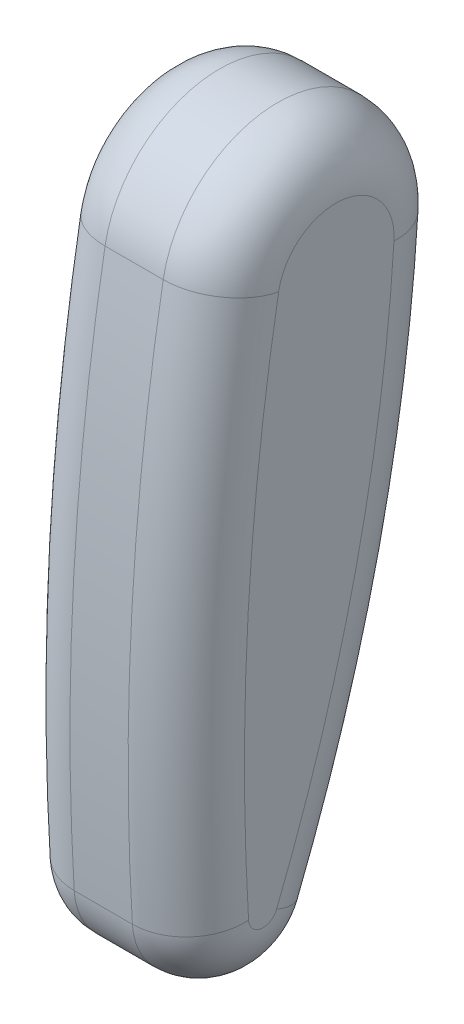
ISO-10303-21;
HEADER;
FILE_DESCRIPTION(('STEP AP214'),'2;1');
FILE_NAME('part.step','',(''),(''),'','','');
FILE_SCHEMA(('AUTOMOTIVE_DESIGN { 1 0 10303 214 1 1 1 1 }'));
ENDSEC;
DATA;
#1=APPLICATION_CONTEXT('core data for automotive mechanical design processes');
#2=APPLICATION_PROTOCOL_DEFINITION('international standard','automotive_design',2000,#1);
#3=PRODUCT_CONTEXT('',#1,'mechanical');
#4=PRODUCT('Part','Part','',(#3));
#5=PRODUCT_RELATED_PRODUCT_CATEGORY('part','',(#4));
#6=PRODUCT_DEFINITION_FORMATION('','',#4);
#7=PRODUCT_DEFINITION_CONTEXT('part definition',#1,'design');
#8=PRODUCT_DEFINITION('design','',#6,#7);
#9=PRODUCT_DEFINITION_SHAPE('','',#8);
#10=(LENGTH_UNIT() NAMED_UNIT(*) SI_UNIT(.MILLI.,.METRE.));
#11=(NAMED_UNIT(*) PLANE_ANGLE_UNIT() SI_UNIT($,.RADIAN.));
#12=(NAMED_UNIT(*) SI_UNIT($,.STERADIAN.) SOLID_ANGLE_UNIT());
#13=UNCERTAINTY_MEASURE_WITH_UNIT(LENGTH_MEASURE(1.E-05),#10,'distance_accuracy_value','');
#14=(GEOMETRIC_REPRESENTATION_CONTEXT(3) GLOBAL_UNCERTAINTY_ASSIGNED_CONTEXT((#13)) GLOBAL_UNIT_ASSIGNED_CONTEXT((#10,
#11,#12)) REPRESENTATION_CONTEXT('',''));
#15=CARTESIAN_POINT('',(0.,0.,0.));
#16=DIRECTION('',(0.,0.,1.));
#17=DIRECTION('',(1.,0.,0.));
#18=AXIS2_PLACEMENT_3D('',#15,#16,#17);
#19=CARTESIAN_POINT('',(38.1,-636.965855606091,-1940.75192617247));
#20=DIRECTION('',(1.,0.,0.));
#21=DIRECTION('',(0.,0.,-1.));
#22=AXIS2_PLACEMENT_3D('',#19,#20,#21);
#23=CYLINDRICAL_SURFACE('',#22,2032.);
#24=DIRECTION('',(1.,0.,0.));
#25=VECTOR('',#24,1.);
#26=CARTESIAN_POINT('',(38.1,-759.542851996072,87.547578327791));
#27=LINE('',#26,#25);
#28=CARTESIAN_POINT('',(88.9,-759.542851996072,87.547578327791));
#29=VERTEX_POINT('',#28);
#30=CARTESIAN_POINT('',(139.7,-759.542851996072,87.547578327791));
#31=VERTEX_POINT('',#30);
#32=EDGE_CURVE('E129',#29,#31,#27,.T.);
#33=ORIENTED_EDGE('',*,*,#32,.T.);
#34=CARTESIAN_POINT('',(139.7,-636.965855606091,-1940.75192617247));
#35=DIRECTION('',(-1.,0.,0.));
#36=DIRECTION('',(0.,0.,1.));
#37=AXIS2_PLACEMENT_3D('',#34,#35,#36);
#38=CIRCLE('',#37,2032.);
#39=CARTESIAN_POINT('',(139.7,-285.382596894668,60.6009193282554));
#40=VERTEX_POINT('',#39);
#41=EDGE_CURVE('E11',#31,#40,#38,.T.);
#42=ORIENTED_EDGE('',*,*,#41,.T.);
#43=DIRECTION('',(1.,0.,0.));
#44=VECTOR('',#43,1.);
#45=CARTESIAN_POINT('',(38.1,-285.382596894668,60.6009193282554));
#46=LINE('',#45,#44);
#47=CARTESIAN_POINT('',(88.9,-285.382596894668,60.6009193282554));
#48=VERTEX_POINT('',#47);
#49=EDGE_CURVE('E123',#48,#40,#46,.T.);
#50=ORIENTED_EDGE('',*,*,#49,.F.);
#51=CARTESIAN_POINT('',(88.9,-636.965855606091,-1940.75192617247));
#52=DIRECTION('',(-1.,0.,0.));
#53=DIRECTION('',(0.,0.,1.));
#54=AXIS2_PLACEMENT_3D('',#51,#52,#53);
#55=CIRCLE('',#54,2032.);
#56=EDGE_CURVE('E44',#48,#29,#55,.F.);
#57=ORIENTED_EDGE('',*,*,#56,.T.);
#58=EDGE_LOOP('',(#33,#42,#50,#57));
#59=FACE_BOUND('',#58,.T.);
#60=ADVANCED_FACE('F35',(#59),#23,.T.);
#61=CARTESIAN_POINT('',(38.1,-302.961759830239,-39.4667229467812));
#62=DIRECTION('',(1.,0.,0.));
#63=DIRECTION('',(0.,0.,-1.));
#64=AXIS2_PLACEMENT_3D('',#61,#62,#63);
#65=CYLINDRICAL_SURFACE('',#64,101.6);
#66=ORIENTED_EDGE('',*,*,#49,.T.);
#67=CARTESIAN_POINT('',(139.7,-302.961759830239,-39.4667229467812));
#68=DIRECTION('',(-1.,0.,0.));
#69=DIRECTION('',(0.,0.,1.));
#70=AXIS2_PLACEMENT_3D('',#67,#68,#69);
#71=CIRCLE('',#70,101.6);
#72=CARTESIAN_POINT('',(139.7,-309.38746156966,-140.863322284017));
#73=VERTEX_POINT('',#72);
#74=EDGE_CURVE('E126',#40,#73,#71,.T.);
#75=ORIENTED_EDGE('',*,*,#74,.T.);
#76=DIRECTION('',(1.,0.,0.));
#77=VECTOR('',#76,1.);
#78=CARTESIAN_POINT('',(38.1,-309.38746156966,-140.863322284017));
#79=LINE('',#78,#77);
#80=CARTESIAN_POINT('',(88.9,-309.38746156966,-140.863322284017));
#81=VERTEX_POINT('',#80);
#82=EDGE_CURVE('E179',#81,#73,#79,.T.);
#83=ORIENTED_EDGE('',*,*,#82,.F.);
#84=CARTESIAN_POINT('',(88.9,-302.961759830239,-39.4667229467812));
#85=DIRECTION('',(-1.,0.,0.));
#86=DIRECTION('',(0.,0.,1.));
#87=AXIS2_PLACEMENT_3D('',#84,#85,#86);
#88=CIRCLE('',#87,101.6);
#89=EDGE_CURVE('E157',#81,#48,#88,.F.);
#90=ORIENTED_EDGE('',*,*,#89,.T.);
#91=EDGE_LOOP('',(#66,#75,#83,#90));
#92=FACE_BOUND('',#91,.T.);
#93=ADVANCED_FACE('F184',(#92),#65,.T.);
#94=CARTESIAN_POINT('',(38.1,-213.001935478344,1380.08566777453));
#95=DIRECTION('',(1.,0.,0.));
#96=DIRECTION('',(0.,0.,-1.));
#97=AXIS2_PLACEMENT_3D('',#94,#95,#96);
#98=CYLINDRICAL_SURFACE('',#97,1524.);
#99=ORIENTED_EDGE('',*,*,#82,.T.);
#100=CARTESIAN_POINT('',(139.7,-213.001935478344,1380.08566777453));
#101=DIRECTION('',(-1.,0.,0.));
#102=DIRECTION('',(0.,0.,1.));
#103=AXIS2_PLACEMENT_3D('',#100,#101,#102);
#104=CIRCLE('',#103,1524.);
#105=CARTESIAN_POINT('',(139.7,-779.308424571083,-34.7899311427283));
#106=VERTEX_POINT('',#105);
#107=EDGE_CURVE('E168',#73,#106,#104,.T.);
#108=ORIENTED_EDGE('',*,*,#107,.T.);
#109=DIRECTION('',(1.,0.,0.));
#110=VECTOR('',#109,1.);
#111=CARTESIAN_POINT('',(38.1,-779.308424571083,-34.7899311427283));
#112=LINE('',#111,#110);
#113=CARTESIAN_POINT('',(88.9,-779.308424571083,-34.7899311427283));
#114=VERTEX_POINT('',#113);
#115=EDGE_CURVE('E177',#114,#106,#112,.T.);
#116=ORIENTED_EDGE('',*,*,#115,.F.);
#117=CARTESIAN_POINT('',(88.9,-213.001935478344,1380.08566777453));
#118=DIRECTION('',(-1.,0.,0.));
#119=DIRECTION('',(0.,0.,1.));
#120=AXIS2_PLACEMENT_3D('',#117,#118,#119);
#121=CIRCLE('',#120,1524.);
#122=EDGE_CURVE('E171',#114,#81,#121,.F.);
#123=ORIENTED_EDGE('',*,*,#122,.T.);
#124=EDGE_LOOP('',(#99,#108,#116,#123));
#125=FACE_BOUND('',#124,.T.);
#126=ADVANCED_FACE('F194',(#125),#98,.T.);
#127=CARTESIAN_POINT('',(38.1,-755.712320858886,24.1632188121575));
#128=DIRECTION('',(1.,0.,0.));
#129=DIRECTION('',(0.,0.,-1.));
#130=AXIS2_PLACEMENT_3D('',#127,#128,#129);
#131=CYLINDRICAL_SURFACE('',#130,63.5000000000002);
#132=ORIENTED_EDGE('',*,*,#115,.T.);
#133=CARTESIAN_POINT('',(139.7,-755.712320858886,24.1632188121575));
#134=DIRECTION('',(-1.,0.,0.));
#135=DIRECTION('',(0.,0.,1.));
#136=AXIS2_PLACEMENT_3D('',#133,#134,#135);
#137=CIRCLE('',#136,63.5000000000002);
#138=EDGE_CURVE('E52',#106,#31,#137,.T.);
#139=ORIENTED_EDGE('',*,*,#138,.T.);
#140=ORIENTED_EDGE('',*,*,#32,.F.);
#141=CARTESIAN_POINT('',(88.9,-755.712320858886,24.1632188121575));
#142=DIRECTION('',(-1.,0.,0.));
#143=DIRECTION('',(0.,0.,1.));
#144=AXIS2_PLACEMENT_3D('',#141,#142,#143);
#145=CIRCLE('',#144,63.5000000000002);
#146=EDGE_CURVE('E154',#29,#114,#145,.F.);
#147=ORIENTED_EDGE('',*,*,#146,.T.);
#148=EDGE_LOOP('',(#132,#139,#140,#147));
#149=FACE_BOUND('',#148,.T.);
#150=ADVANCED_FACE('F192',(#149),#131,.T.);
#151=CARTESIAN_POINT('',(38.1,-469.963807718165,-990.109324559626));
#152=DIRECTION('',(-1.,0.,0.));
#153=DIRECTION('',(0.,0.,1.));
#154=AXIS2_PLACEMENT_3D('',#151,#152,#153);
#155=PLANE('',#154);
#156=CARTESIAN_POINT('',(38.1,-302.961759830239,-39.4667229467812));
#157=DIRECTION('',(-1.,0.,0.));
#158=DIRECTION('',(0.,0.,1.));
#159=AXIS2_PLACEMENT_3D('',#156,#157,#158);
#160=CIRCLE('',#159,50.8000000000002);
#161=CARTESIAN_POINT('',(38.1,-294.172178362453,10.5670981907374));
#162=VERTEX_POINT('',#161);
#163=CARTESIAN_POINT('',(38.1,-306.174610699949,-90.1650226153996));
#164=VERTEX_POINT('',#163);
#165=EDGE_CURVE('E162',#162,#164,#160,.T.);
#166=ORIENTED_EDGE('',*,*,#165,.T.);
#167=CARTESIAN_POINT('',(38.1,-213.001935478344,1380.08566777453));
#168=DIRECTION('',(-1.,0.,0.));
#169=DIRECTION('',(0.,0.,1.));
#170=AXIS2_PLACEMENT_3D('',#167,#168,#169);
#171=CIRCLE('',#170,1473.2);
#172=CARTESIAN_POINT('',(38.1,-760.431541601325,12.3725888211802));
#173=VERTEX_POINT('',#172);
#174=EDGE_CURVE('E159',#164,#173,#171,.T.);
#175=ORIENTED_EDGE('',*,*,#174,.T.);
#176=CARTESIAN_POINT('',(38.1,-755.712320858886,24.1632188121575));
#177=DIRECTION('',(-1.,0.,0.));
#178=DIRECTION('',(0.,0.,1.));
#179=AXIS2_PLACEMENT_3D('',#176,#177,#178);
#180=CIRCLE('',#179,12.7000000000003);
#181=CARTESIAN_POINT('',(38.1,-756.478427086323,36.8400907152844));
#182=VERTEX_POINT('',#181);
#183=EDGE_CURVE('E164',#173,#182,#180,.T.);
#184=ORIENTED_EDGE('',*,*,#183,.T.);
#185=CARTESIAN_POINT('',(38.1,-636.965855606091,-1940.75192617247));
#186=DIRECTION('',(-1.,0.,0.));
#187=DIRECTION('',(0.,0.,1.));
#188=AXIS2_PLACEMENT_3D('',#185,#186,#187);
#189=CIRCLE('',#188,1981.2);
#190=EDGE_CURVE('E166',#182,#162,#189,.T.);
#191=ORIENTED_EDGE('',*,*,#190,.T.);
#192=EDGE_LOOP('',(#166,#175,#184,#191));
#193=FACE_BOUND('',#192,.T.);
#194=ADVANCED_FACE('F237',(#193),#155,.T.);
#195=CARTESIAN_POINT('',(190.5,-469.963807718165,-990.109324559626));
#196=DIRECTION('',(-1.,0.,0.));
#197=DIRECTION('',(0.,0.,1.));
#198=AXIS2_PLACEMENT_3D('',#195,#196,#197);
#199=PLANE('',#198);
#200=CARTESIAN_POINT('',(190.5,-755.712320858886,24.1632188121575));
#201=DIRECTION('',(-1.,0.,0.));
#202=DIRECTION('',(0.,0.,1.));
#203=AXIS2_PLACEMENT_3D('',#200,#201,#202);
#204=CIRCLE('',#203,12.7000000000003);
#205=CARTESIAN_POINT('',(190.5,-756.478427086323,36.8400907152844));
#206=VERTEX_POINT('',#205);
#207=CARTESIAN_POINT('',(190.5,-760.431541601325,12.3725888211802));
#208=VERTEX_POINT('',#207);
#209=EDGE_CURVE('E112',#206,#208,#204,.F.);
#210=ORIENTED_EDGE('',*,*,#209,.T.);
#211=CARTESIAN_POINT('',(190.5,-213.001935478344,1380.08566777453));
#212=DIRECTION('',(-1.,0.,0.));
#213=DIRECTION('',(0.,0.,1.));
#214=AXIS2_PLACEMENT_3D('',#211,#212,#213);
#215=CIRCLE('',#214,1473.2);
#216=CARTESIAN_POINT('',(190.5,-306.174610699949,-90.1650226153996));
#217=VERTEX_POINT('',#216);
#218=EDGE_CURVE('E108',#208,#217,#215,.F.);
#219=ORIENTED_EDGE('',*,*,#218,.T.);
#220=CARTESIAN_POINT('',(190.5,-302.961759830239,-39.4667229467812));
#221=DIRECTION('',(-1.,0.,0.));
#222=DIRECTION('',(0.,0.,1.));
#223=AXIS2_PLACEMENT_3D('',#220,#221,#222);
#224=CIRCLE('',#223,50.8000000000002);
#225=CARTESIAN_POINT('',(190.5,-294.172178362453,10.5670981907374));
#226=VERTEX_POINT('',#225);
#227=EDGE_CURVE('E102',#217,#226,#224,.F.);
#228=ORIENTED_EDGE('',*,*,#227,.T.);
#229=CARTESIAN_POINT('',(190.5,-636.965855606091,-1940.75192617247));
#230=DIRECTION('',(-1.,0.,0.));
#231=DIRECTION('',(0.,0.,1.));
#232=AXIS2_PLACEMENT_3D('',#229,#230,#231);
#233=CIRCLE('',#232,1981.2);
#234=EDGE_CURVE('E105',#226,#206,#233,.F.);
#235=ORIENTED_EDGE('',*,*,#234,.T.);
#236=EDGE_LOOP('',(#210,#219,#228,#235));
#237=FACE_BOUND('',#236,.T.);
#238=ADVANCED_FACE('F104',(#237),#199,.F.);
#239=CARTESIAN_POINT('',(139.7,-636.965855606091,-1940.75192617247));
#240=DIRECTION('',(-1.,0.,0.));
#241=DIRECTION('',(0.,0.,1.));
#242=AXIS2_PLACEMENT_3D('',#239,#240,#241);
#243=TOROIDAL_SURFACE('',#242,1981.2,50.8);
#244=CARTESIAN_POINT('',(139.7,-294.172178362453,10.5670981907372));
#245=DIRECTION('',(0.,0.984917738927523,-0.173023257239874));
#246=DIRECTION('',(0.,0.173023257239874,0.984917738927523));
#247=AXIS2_PLACEMENT_3D('',#244,#245,#246);
#248=CIRCLE('',#247,50.8);
#249=EDGE_CURVE('E118',#40,#226,#248,.T.);
#250=ORIENTED_EDGE('',*,*,#249,.F.);
#251=ORIENTED_EDGE('',*,*,#41,.F.);
#252=CARTESIAN_POINT('',(139.7,-756.478427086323,36.8400907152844));
#253=DIRECTION('',(0.,-0.998178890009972,-0.060323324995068));
#254=DIRECTION('',(0.,0.060323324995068,-0.998178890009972));
#255=AXIS2_PLACEMENT_3D('',#252,#253,#254);
#256=CIRCLE('',#255,50.8);
#257=EDGE_CURVE('E121',#206,#31,#256,.T.);
#258=ORIENTED_EDGE('',*,*,#257,.F.);
#259=ORIENTED_EDGE('',*,*,#234,.F.);
#260=EDGE_LOOP('',(#250,#251,#258,#259));
#261=FACE_BOUND('',#260,.T.);
#262=ADVANCED_FACE('F116',(#261),#243,.T.);
#263=CARTESIAN_POINT('',(139.7,-755.712320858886,24.1632188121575));
#264=DIRECTION('',(-1.,0.,0.));
#265=DIRECTION('',(0.,0.,1.));
#266=AXIS2_PLACEMENT_3D('',#263,#264,#265);
#267=DEGENERATE_TOROIDAL_SURFACE('',#266,12.7000000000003,50.8,.T.);
#268=ORIENTED_EDGE('',*,*,#257,.T.);
#269=ORIENTED_EDGE('',*,*,#138,.F.);
#270=CARTESIAN_POINT('',(139.7,-760.431541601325,12.3725888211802));
#271=DIRECTION('',(0.,0.928396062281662,-0.371592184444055));
#272=DIRECTION('',(0.,0.371592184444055,0.928396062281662));
#273=AXIS2_PLACEMENT_3D('',#270,#271,#272);
#274=CIRCLE('',#273,50.8);
#275=EDGE_CURVE('E127',#208,#106,#274,.T.);
#276=ORIENTED_EDGE('',*,*,#275,.F.);
#277=ORIENTED_EDGE('',*,*,#209,.F.);
#278=EDGE_LOOP('',(#268,#269,#276,#277));
#279=FACE_BOUND('',#278,.T.);
#280=ADVANCED_FACE('F198',(#279),#267,.T.);
#281=CARTESIAN_POINT('',(139.7,-302.961759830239,-39.4667229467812));
#282=DIRECTION('',(-1.,0.,0.));
#283=DIRECTION('',(0.,0.,1.));
#284=AXIS2_PLACEMENT_3D('',#281,#282,#283);
#285=TOROIDAL_SURFACE('',#284,50.8000000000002,50.8);
#286=ORIENTED_EDGE('',*,*,#249,.T.);
#287=ORIENTED_EDGE('',*,*,#227,.F.);
#288=CARTESIAN_POINT('',(139.7,-306.174610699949,-90.1650226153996));
#289=DIRECTION('',(0.,-0.997998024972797,0.0632450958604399));
#290=DIRECTION('',(0.,-0.0632450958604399,-0.997998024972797));
#291=AXIS2_PLACEMENT_3D('',#288,#289,#290);
#292=CIRCLE('',#291,50.8);
#293=EDGE_CURVE('E131',#73,#217,#292,.T.);
#294=ORIENTED_EDGE('',*,*,#293,.F.);
#295=ORIENTED_EDGE('',*,*,#74,.F.);
#296=EDGE_LOOP('',(#286,#287,#294,#295));
#297=FACE_BOUND('',#296,.T.);
#298=ADVANCED_FACE('F125',(#297),#285,.T.);
#299=CARTESIAN_POINT('',(139.7,-213.001935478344,1380.08566777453));
#300=DIRECTION('',(-1.,0.,0.));
#301=DIRECTION('',(0.,0.,1.));
#302=AXIS2_PLACEMENT_3D('',#299,#300,#301);
#303=TOROIDAL_SURFACE('',#302,1473.2,50.8);
#304=ORIENTED_EDGE('',*,*,#275,.T.);
#305=ORIENTED_EDGE('',*,*,#107,.F.);
#306=ORIENTED_EDGE('',*,*,#293,.T.);
#307=ORIENTED_EDGE('',*,*,#218,.F.);
#308=EDGE_LOOP('',(#304,#305,#306,#307));
#309=FACE_BOUND('',#308,.T.);
#310=ADVANCED_FACE('F195',(#309),#303,.T.);
#311=CARTESIAN_POINT('',(88.9,-636.965855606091,-1940.75192617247));
#312=DIRECTION('',(-1.,0.,0.));
#313=DIRECTION('',(0.,0.,1.));
#314=AXIS2_PLACEMENT_3D('',#311,#312,#313);
#315=TOROIDAL_SURFACE('',#314,1981.2,50.8);
#316=CARTESIAN_POINT('',(88.9,-294.172178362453,10.5670981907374));
#317=DIRECTION('',(0.,0.984917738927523,-0.173023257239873));
#318=DIRECTION('',(0.,0.173023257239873,0.984917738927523));
#319=AXIS2_PLACEMENT_3D('',#316,#317,#318);
#320=CIRCLE('',#319,50.8);
#321=EDGE_CURVE('E138',#162,#48,#320,.T.);
#322=ORIENTED_EDGE('',*,*,#321,.F.);
#323=ORIENTED_EDGE('',*,*,#190,.F.);
#324=CARTESIAN_POINT('',(88.9,-756.478427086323,36.8400907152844));
#325=DIRECTION('',(0.,-0.998178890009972,-0.0603233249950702));
#326=DIRECTION('',(0.,0.0603233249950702,-0.998178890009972));
#327=AXIS2_PLACEMENT_3D('',#324,#325,#326);
#328=CIRCLE('',#327,50.8);
#329=EDGE_CURVE('E39',#29,#182,#328,.T.);
#330=ORIENTED_EDGE('',*,*,#329,.F.);
#331=ORIENTED_EDGE('',*,*,#56,.F.);
#332=EDGE_LOOP('',(#322,#323,#330,#331));
#333=FACE_BOUND('',#332,.T.);
#334=ADVANCED_FACE('F37',(#333),#315,.T.);
#335=CARTESIAN_POINT('',(88.9,-755.712320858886,24.1632188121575));
#336=DIRECTION('',(-1.,0.,0.));
#337=DIRECTION('',(0.,0.,1.));
#338=AXIS2_PLACEMENT_3D('',#335,#336,#337);
#339=DEGENERATE_TOROIDAL_SURFACE('',#338,12.7000000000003,50.8,.T.);
#340=ORIENTED_EDGE('',*,*,#329,.T.);
#341=ORIENTED_EDGE('',*,*,#183,.F.);
#342=CARTESIAN_POINT('',(88.9,-760.431541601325,12.3725888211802));
#343=DIRECTION('',(0.,0.928396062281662,-0.371592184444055));
#344=DIRECTION('',(0.,0.371592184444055,0.928396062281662));
#345=AXIS2_PLACEMENT_3D('',#342,#343,#344);
#346=CIRCLE('',#345,50.8);
#347=EDGE_CURVE('E137',#114,#173,#346,.T.);
#348=ORIENTED_EDGE('',*,*,#347,.F.);
#349=ORIENTED_EDGE('',*,*,#146,.F.);
#350=EDGE_LOOP('',(#340,#341,#348,#349));
#351=FACE_BOUND('',#350,.T.);
#352=ADVANCED_FACE('F189',(#351),#339,.T.);
#353=CARTESIAN_POINT('',(88.9,-302.961759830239,-39.4667229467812));
#354=DIRECTION('',(-1.,0.,0.));
#355=DIRECTION('',(0.,0.,1.));
#356=AXIS2_PLACEMENT_3D('',#353,#354,#355);
#357=TOROIDAL_SURFACE('',#356,50.8000000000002,50.8);
#358=ORIENTED_EDGE('',*,*,#321,.T.);
#359=ORIENTED_EDGE('',*,*,#89,.F.);
#360=CARTESIAN_POINT('',(88.9,-306.174610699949,-90.1650226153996));
#361=DIRECTION('',(0.,-0.997998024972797,0.0632450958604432));
#362=DIRECTION('',(0.,-0.0632450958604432,-0.997998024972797));
#363=AXIS2_PLACEMENT_3D('',#360,#361,#362);
#364=CIRCLE('',#363,50.8);
#365=EDGE_CURVE('E135',#164,#81,#364,.T.);
#366=ORIENTED_EDGE('',*,*,#365,.F.);
#367=ORIENTED_EDGE('',*,*,#165,.F.);
#368=EDGE_LOOP('',(#358,#359,#366,#367));
#369=FACE_BOUND('',#368,.T.);
#370=ADVANCED_FACE('F223',(#369),#357,.T.);
#371=CARTESIAN_POINT('',(88.9,-213.001935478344,1380.08566777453));
#372=DIRECTION('',(-1.,0.,0.));
#373=DIRECTION('',(0.,0.,1.));
#374=AXIS2_PLACEMENT_3D('',#371,#372,#373);
#375=TOROIDAL_SURFACE('',#374,1473.2,50.8);
#376=ORIENTED_EDGE('',*,*,#347,.T.);
#377=ORIENTED_EDGE('',*,*,#174,.F.);
#378=ORIENTED_EDGE('',*,*,#365,.T.);
#379=ORIENTED_EDGE('',*,*,#122,.F.);
#380=EDGE_LOOP('',(#376,#377,#378,#379));
#381=FACE_BOUND('',#380,.T.);
#382=ADVANCED_FACE('F227',(#381),#375,.T.);
#383=CLOSED_SHELL('',(#60,#93,#126,#150,#194,#238,#262,#280,#298,#310,#334,#352,#370,#382));
#384=MANIFOLD_SOLID_BREP('B2',#383);
#385=ADVANCED_BREP_SHAPE_REPRESENTATION('',(#18,#384),#14);
#386=SHAPE_DEFINITION_REPRESENTATION(#9,#385);
ENDSEC;
END-ISO-10303-21;
